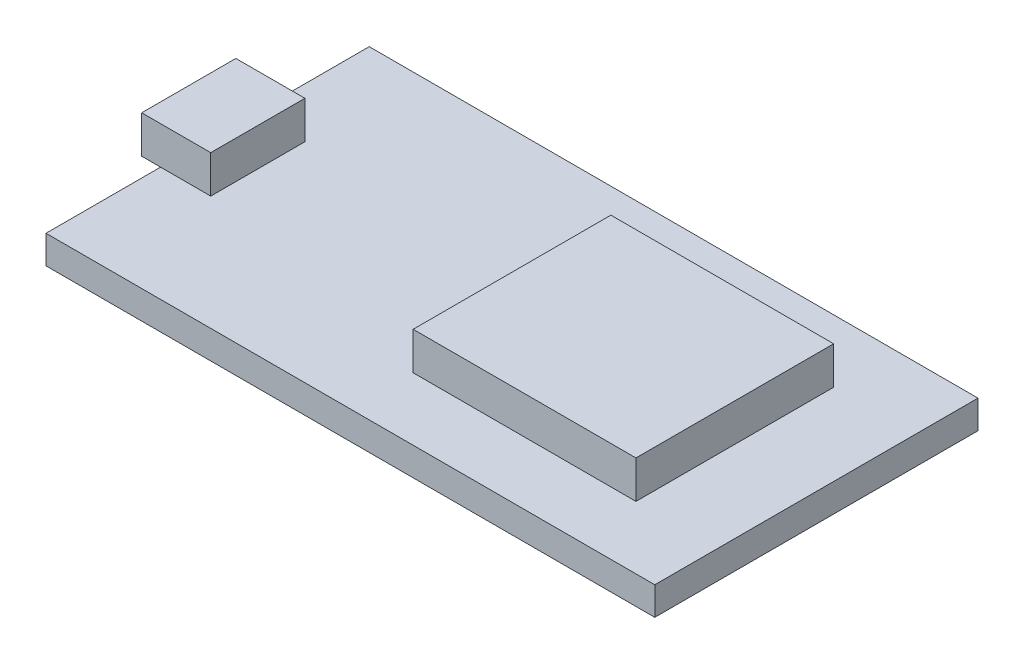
ISO-10303-21;
HEADER;
FILE_DESCRIPTION(('STEP AP214'),'2;1');
FILE_NAME('part.step','',(''),(''),'','','');
FILE_SCHEMA(('AUTOMOTIVE_DESIGN { 1 0 10303 214 1 1 1 1 }'));
ENDSEC;
DATA;
#1=APPLICATION_CONTEXT('core data for automotive mechanical design processes');
#2=APPLICATION_PROTOCOL_DEFINITION('international standard','automotive_design',2000,#1);
#3=PRODUCT_CONTEXT('',#1,'mechanical');
#4=PRODUCT('Part','Part','',(#3));
#5=PRODUCT_RELATED_PRODUCT_CATEGORY('part','',(#4));
#6=PRODUCT_DEFINITION_FORMATION('','',#4);
#7=PRODUCT_DEFINITION_CONTEXT('part definition',#1,'design');
#8=PRODUCT_DEFINITION('design','',#6,#7);
#9=PRODUCT_DEFINITION_SHAPE('','',#8);
#10=(LENGTH_UNIT() NAMED_UNIT(*) SI_UNIT(.MILLI.,.METRE.));
#11=(NAMED_UNIT(*) PLANE_ANGLE_UNIT() SI_UNIT($,.RADIAN.));
#12=(NAMED_UNIT(*) SI_UNIT($,.STERADIAN.) SOLID_ANGLE_UNIT());
#13=UNCERTAINTY_MEASURE_WITH_UNIT(LENGTH_MEASURE(1.E-05),#10,'distance_accuracy_value','');
#14=(GEOMETRIC_REPRESENTATION_CONTEXT(3) GLOBAL_UNCERTAINTY_ASSIGNED_CONTEXT((#13)) GLOBAL_UNIT_ASSIGNED_CONTEXT((#10,
#11,#12)) REPRESENTATION_CONTEXT('',''));
#15=CARTESIAN_POINT('',(0.,0.,0.));
#16=DIRECTION('',(0.,0.,1.));
#17=DIRECTION('',(1.,0.,0.));
#18=AXIS2_PLACEMENT_3D('',#15,#16,#17);
#19=CARTESIAN_POINT('',(-1.5,5.25,-9.125));
#20=DIRECTION('',(1.,0.,0.));
#21=DIRECTION('',(0.,0.,-1.));
#22=AXIS2_PLACEMENT_3D('',#19,#20,#21);
#23=PLANE('',#22);
#24=DIRECTION('',(0.,0.,1.));
#25=VECTOR('',#24,1.);
#26=CARTESIAN_POINT('',(-1.5,2.25,-9.125));
#27=LINE('',#26,#25);
#28=CARTESIAN_POINT('',(-1.5,2.25,-16.625));
#29=VERTEX_POINT('',#28);
#30=CARTESIAN_POINT('',(-1.5,2.25,-9.125));
#31=VERTEX_POINT('',#30);
#32=EDGE_CURVE('E320',#29,#31,#27,.T.);
#33=ORIENTED_EDGE('',*,*,#32,.T.);
#34=DIRECTION('',(0.,-1.,0.));
#35=VECTOR('',#34,1.);
#36=CARTESIAN_POINT('',(-1.5,5.25,-9.125));
#37=LINE('',#36,#35);
#38=CARTESIAN_POINT('',(-1.5,5.25,-9.125));
#39=VERTEX_POINT('',#38);
#40=EDGE_CURVE('E330',#39,#31,#37,.T.);
#41=ORIENTED_EDGE('',*,*,#40,.F.);
#42=DIRECTION('',(0.,0.,1.));
#43=VECTOR('',#42,1.);
#44=CARTESIAN_POINT('',(-1.5,5.25,-9.125));
#45=LINE('',#44,#43);
#46=CARTESIAN_POINT('',(-1.5,5.25,-16.625));
#47=VERTEX_POINT('',#46);
#48=EDGE_CURVE('E307',#47,#39,#45,.T.);
#49=ORIENTED_EDGE('',*,*,#48,.F.);
#50=DIRECTION('',(0.,-1.,0.));
#51=VECTOR('',#50,1.);
#52=CARTESIAN_POINT('',(-1.5,5.25,-16.625));
#53=LINE('',#52,#51);
#54=EDGE_CURVE('E334',#47,#29,#53,.T.);
#55=ORIENTED_EDGE('',*,*,#54,.T.);
#56=EDGE_LOOP('',(#33,#41,#49,#55));
#57=FACE_BOUND('',#56,.T.);
#58=DIRECTION('',(0.,0.,1.));
#59=VECTOR('',#58,1.);
#60=CARTESIAN_POINT('',(-1.5,2.75,-9.125));
#61=LINE('',#60,#59);
#62=CARTESIAN_POINT('',(-1.5,2.75,-16.125));
#63=VERTEX_POINT('',#62);
#64=CARTESIAN_POINT('',(-1.5,2.75,-9.625));
#65=VERTEX_POINT('',#64);
#66=EDGE_CURVE('E281',#63,#65,#61,.T.);
#67=ORIENTED_EDGE('',*,*,#66,.F.);
#68=DIRECTION('',(0.,-1.,0.));
#69=VECTOR('',#68,1.);
#70=CARTESIAN_POINT('',(-1.5,5.25,-16.125));
#71=LINE('',#70,#69);
#72=CARTESIAN_POINT('',(-1.5,4.75,-16.125));
#73=VERTEX_POINT('',#72);
#74=EDGE_CURVE('E290',#73,#63,#71,.T.);
#75=ORIENTED_EDGE('',*,*,#74,.F.);
#76=DIRECTION('',(0.,0.,1.));
#77=VECTOR('',#76,1.);
#78=CARTESIAN_POINT('',(-1.5,4.75,-9.125));
#79=LINE('',#78,#77);
#80=CARTESIAN_POINT('',(-1.5,4.75,-9.625));
#81=VERTEX_POINT('',#80);
#82=EDGE_CURVE('E55',#73,#81,#79,.T.);
#83=ORIENTED_EDGE('',*,*,#82,.T.);
#84=DIRECTION('',(0.,-1.,0.));
#85=VECTOR('',#84,1.);
#86=CARTESIAN_POINT('',(-1.5,5.25,-9.625));
#87=LINE('',#86,#85);
#88=EDGE_CURVE('E286',#81,#65,#87,.T.);
#89=ORIENTED_EDGE('',*,*,#88,.T.);
#90=EDGE_LOOP('',(#67,#75,#83,#89));
#91=FACE_BOUND('',#90,.T.);
#92=ADVANCED_FACE('F39',(#57,#91),#23,.F.);
#93=CARTESIAN_POINT('',(0.,2.25,0.));
#94=DIRECTION('',(0.,-1.,0.));
#95=DIRECTION('',(0.,0.,-1.));
#96=AXIS2_PLACEMENT_3D('',#93,#94,#95);
#97=PLANE('',#96);
#98=DIRECTION('',(0.,0.,1.));
#99=VECTOR('',#98,1.);
#100=CARTESIAN_POINT('',(24.25,2.25,-20.75));
#101=LINE('',#100,#99);
#102=CARTESIAN_POINT('',(24.25,2.25,-20.75));
#103=VERTEX_POINT('',#102);
#104=CARTESIAN_POINT('',(24.25,2.25,-5.));
#105=VERTEX_POINT('',#104);
#106=EDGE_CURVE('E341',#103,#105,#101,.T.);
#107=ORIENTED_EDGE('',*,*,#106,.F.);
#108=DIRECTION('',(-1.,0.,0.));
#109=VECTOR('',#108,1.);
#110=CARTESIAN_POINT('',(24.25,2.25,-20.75));
#111=LINE('',#110,#109);
#112=CARTESIAN_POINT('',(42.,2.25,-20.75));
#113=VERTEX_POINT('',#112);
#114=EDGE_CURVE('E347',#113,#103,#111,.T.);
#115=ORIENTED_EDGE('',*,*,#114,.F.);
#116=DIRECTION('',(0.,0.,-1.));
#117=VECTOR('',#116,1.);
#118=CARTESIAN_POINT('',(42.,2.25,-20.75));
#119=LINE('',#118,#117);
#120=CARTESIAN_POINT('',(42.,2.25,-5.));
#121=VERTEX_POINT('',#120);
#122=EDGE_CURVE('E364',#121,#113,#119,.T.);
#123=ORIENTED_EDGE('',*,*,#122,.F.);
#124=DIRECTION('',(1.,0.,0.));
#125=VECTOR('',#124,1.);
#126=CARTESIAN_POINT('',(24.25,2.25,-5.));
#127=LINE('',#126,#125);
#128=EDGE_CURVE('E360',#105,#121,#127,.T.);
#129=ORIENTED_EDGE('',*,*,#128,.F.);
#130=EDGE_LOOP('',(#107,#115,#123,#129));
#131=FACE_BOUND('',#130,.T.);
#132=DIRECTION('',(-1.,0.,0.));
#133=VECTOR('',#132,1.);
#134=CARTESIAN_POINT('',(4.,2.25,-16.625));
#135=LINE('',#134,#133);
#136=CARTESIAN_POINT('',(4.,2.25,-16.625));
#137=VERTEX_POINT('',#136);
#138=CARTESIAN_POINT('',(0.,2.25,-16.625));
#139=VERTEX_POINT('',#138);
#140=EDGE_CURVE('E63',#137,#139,#135,.T.);
#141=ORIENTED_EDGE('',*,*,#140,.F.);
#142=DIRECTION('',(0.,0.,-1.));
#143=VECTOR('',#142,1.);
#144=CARTESIAN_POINT('',(4.,2.25,-9.125));
#145=LINE('',#144,#143);
#146=CARTESIAN_POINT('',(4.,2.25,-9.125));
#147=VERTEX_POINT('',#146);
#148=EDGE_CURVE('E280',#147,#137,#145,.T.);
#149=ORIENTED_EDGE('',*,*,#148,.F.);
#150=DIRECTION('',(1.,0.,0.));
#151=VECTOR('',#150,1.);
#152=CARTESIAN_POINT('',(4.,2.25,-9.125));
#153=LINE('',#152,#151);
#154=CARTESIAN_POINT('',(0.,2.25,-9.125));
#155=VERTEX_POINT('',#154);
#156=EDGE_CURVE('E323',#155,#147,#153,.T.);
#157=ORIENTED_EDGE('',*,*,#156,.F.);
#158=DIRECTION('',(0.,0.,1.));
#159=VECTOR('',#158,1.);
#160=CARTESIAN_POINT('',(0.,2.25,0.));
#161=LINE('',#160,#159);
#162=CARTESIAN_POINT('',(0.,2.25,0.));
#163=VERTEX_POINT('',#162);
#164=EDGE_CURVE('E392',#155,#163,#161,.T.);
#165=ORIENTED_EDGE('',*,*,#164,.T.);
#166=DIRECTION('',(1.,0.,0.));
#167=VECTOR('',#166,1.);
#168=CARTESIAN_POINT('',(0.,2.25,0.));
#169=LINE('',#168,#167);
#170=CARTESIAN_POINT('',(48.5,2.25,0.));
#171=VERTEX_POINT('',#170);
#172=EDGE_CURVE('E390',#163,#171,#169,.T.);
#173=ORIENTED_EDGE('',*,*,#172,.T.);
#174=DIRECTION('',(0.,0.,-1.));
#175=VECTOR('',#174,1.);
#176=CARTESIAN_POINT('',(48.5,2.25,0.));
#177=LINE('',#176,#175);
#178=CARTESIAN_POINT('',(48.5,2.25,-25.75));
#179=VERTEX_POINT('',#178);
#180=EDGE_CURVE('E395',#171,#179,#177,.T.);
#181=ORIENTED_EDGE('',*,*,#180,.T.);
#182=DIRECTION('',(-1.,0.,0.));
#183=VECTOR('',#182,1.);
#184=CARTESIAN_POINT('',(0.,2.25,-25.75));
#185=LINE('',#184,#183);
#186=CARTESIAN_POINT('',(0.,2.25,-25.75));
#187=VERTEX_POINT('',#186);
#188=EDGE_CURVE('E398',#179,#187,#185,.T.);
#189=ORIENTED_EDGE('',*,*,#188,.T.);
#190=EDGE_CURVE('E387',#187,#139,#161,.T.);
#191=ORIENTED_EDGE('',*,*,#190,.T.);
#192=EDGE_LOOP('',(#141,#149,#157,#165,#173,#181,#189,#191));
#193=FACE_BOUND('',#192,.T.);
#194=ADVANCED_FACE('F443',(#131,#193),#97,.F.);
#195=CARTESIAN_POINT('',(0.,2.25,0.));
#196=DIRECTION('',(1.,0.,0.));
#197=DIRECTION('',(0.,0.,-1.));
#198=AXIS2_PLACEMENT_3D('',#195,#196,#197);
#199=PLANE('',#198);
#200=DIRECTION('',(0.,0.,1.));
#201=VECTOR('',#200,1.);
#202=CARTESIAN_POINT('',(0.,0.,0.));
#203=LINE('',#202,#201);
#204=CARTESIAN_POINT('',(0.,0.,-25.75));
#205=VERTEX_POINT('',#204);
#206=CARTESIAN_POINT('',(0.,0.,0.));
#207=VERTEX_POINT('',#206);
#208=EDGE_CURVE('E386',#205,#207,#203,.T.);
#209=ORIENTED_EDGE('',*,*,#208,.T.);
#210=DIRECTION('',(0.,-1.,0.));
#211=VECTOR('',#210,1.);
#212=CARTESIAN_POINT('',(0.,2.25,0.));
#213=LINE('',#212,#211);
#214=EDGE_CURVE('E11',#163,#207,#213,.T.);
#215=ORIENTED_EDGE('',*,*,#214,.F.);
#216=ORIENTED_EDGE('',*,*,#164,.F.);
#217=EDGE_CURVE('E391',#139,#155,#161,.T.);
#218=ORIENTED_EDGE('',*,*,#217,.F.);
#219=ORIENTED_EDGE('',*,*,#190,.F.);
#220=DIRECTION('',(0.,-1.,0.));
#221=VECTOR('',#220,1.);
#222=CARTESIAN_POINT('',(0.,2.25,-25.75));
#223=LINE('',#222,#221);
#224=EDGE_CURVE('E401',#187,#205,#223,.T.);
#225=ORIENTED_EDGE('',*,*,#224,.T.);
#226=EDGE_LOOP('',(#209,#215,#216,#218,#219,#225));
#227=FACE_BOUND('',#226,.T.);
#228=ADVANCED_FACE('F41',(#227),#199,.F.);
#229=CARTESIAN_POINT('',(0.,2.25,0.));
#230=DIRECTION('',(0.,0.,-1.));
#231=DIRECTION('',(-1.,0.,0.));
#232=AXIS2_PLACEMENT_3D('',#229,#230,#231);
#233=PLANE('',#232);
#234=DIRECTION('',(1.,0.,0.));
#235=VECTOR('',#234,1.);
#236=CARTESIAN_POINT('',(0.,0.,0.));
#237=LINE('',#236,#235);
#238=CARTESIAN_POINT('',(48.5,0.,0.));
#239=VERTEX_POINT('',#238);
#240=EDGE_CURVE('E405',#207,#239,#237,.T.);
#241=ORIENTED_EDGE('',*,*,#240,.T.);
#242=DIRECTION('',(0.,-1.,0.));
#243=VECTOR('',#242,1.);
#244=CARTESIAN_POINT('',(48.5,2.25,0.));
#245=LINE('',#244,#243);
#246=EDGE_CURVE('E48',#171,#239,#245,.T.);
#247=ORIENTED_EDGE('',*,*,#246,.F.);
#248=ORIENTED_EDGE('',*,*,#172,.F.);
#249=ORIENTED_EDGE('',*,*,#214,.T.);
#250=EDGE_LOOP('',(#241,#247,#248,#249));
#251=FACE_BOUND('',#250,.T.);
#252=ADVANCED_FACE('F607',(#251),#233,.F.);
#253=CARTESIAN_POINT('',(48.5,2.25,0.));
#254=DIRECTION('',(-1.,0.,0.));
#255=DIRECTION('',(0.,0.,1.));
#256=AXIS2_PLACEMENT_3D('',#253,#254,#255);
#257=PLANE('',#256);
#258=DIRECTION('',(0.,0.,-1.));
#259=VECTOR('',#258,1.);
#260=CARTESIAN_POINT('',(48.5,0.,0.));
#261=LINE('',#260,#259);
#262=CARTESIAN_POINT('',(48.5,0.,-25.75));
#263=VERTEX_POINT('',#262);
#264=EDGE_CURVE('E408',#239,#263,#261,.T.);
#265=ORIENTED_EDGE('',*,*,#264,.T.);
#266=DIRECTION('',(0.,-1.,0.));
#267=VECTOR('',#266,1.);
#268=CARTESIAN_POINT('',(48.5,2.25,-25.75));
#269=LINE('',#268,#267);
#270=EDGE_CURVE('E417',#179,#263,#269,.T.);
#271=ORIENTED_EDGE('',*,*,#270,.F.);
#272=ORIENTED_EDGE('',*,*,#180,.F.);
#273=ORIENTED_EDGE('',*,*,#246,.T.);
#274=EDGE_LOOP('',(#265,#271,#272,#273));
#275=FACE_BOUND('',#274,.T.);
#276=ADVANCED_FACE('F426',(#275),#257,.F.);
#277=CARTESIAN_POINT('',(0.,2.25,-25.75));
#278=DIRECTION('',(0.,0.,1.));
#279=DIRECTION('',(1.,0.,0.));
#280=AXIS2_PLACEMENT_3D('',#277,#278,#279);
#281=PLANE('',#280);
#282=DIRECTION('',(-1.,0.,0.));
#283=VECTOR('',#282,1.);
#284=CARTESIAN_POINT('',(0.,0.,-25.75));
#285=LINE('',#284,#283);
#286=EDGE_CURVE('E411',#263,#205,#285,.T.);
#287=ORIENTED_EDGE('',*,*,#286,.T.);
#288=ORIENTED_EDGE('',*,*,#224,.F.);
#289=ORIENTED_EDGE('',*,*,#188,.F.);
#290=ORIENTED_EDGE('',*,*,#270,.T.);
#291=EDGE_LOOP('',(#287,#288,#289,#290));
#292=FACE_BOUND('',#291,.T.);
#293=ADVANCED_FACE('F436',(#292),#281,.F.);
#294=CARTESIAN_POINT('',(0.,0.,0.));
#295=DIRECTION('',(0.,-1.,0.));
#296=DIRECTION('',(0.,0.,-1.));
#297=AXIS2_PLACEMENT_3D('',#294,#295,#296);
#298=PLANE('',#297);
#299=ORIENTED_EDGE('',*,*,#208,.F.);
#300=ORIENTED_EDGE('',*,*,#286,.F.);
#301=ORIENTED_EDGE('',*,*,#264,.F.);
#302=ORIENTED_EDGE('',*,*,#240,.F.);
#303=EDGE_LOOP('',(#299,#300,#301,#302));
#304=FACE_BOUND('',#303,.T.);
#305=ADVANCED_FACE('F433',(#304),#298,.T.);
#306=CARTESIAN_POINT('',(24.25,5.25,-20.75));
#307=DIRECTION('',(1.,0.,0.));
#308=DIRECTION('',(0.,0.,-1.));
#309=AXIS2_PLACEMENT_3D('',#306,#307,#308);
#310=PLANE('',#309);
#311=ORIENTED_EDGE('',*,*,#106,.T.);
#312=DIRECTION('',(0.,-1.,0.));
#313=VECTOR('',#312,1.);
#314=CARTESIAN_POINT('',(24.25,5.25,-5.));
#315=LINE('',#314,#313);
#316=CARTESIAN_POINT('',(24.25,5.25,-5.));
#317=VERTEX_POINT('',#316);
#318=EDGE_CURVE('E382',#317,#105,#315,.T.);
#319=ORIENTED_EDGE('',*,*,#318,.F.);
#320=DIRECTION('',(0.,0.,1.));
#321=VECTOR('',#320,1.);
#322=CARTESIAN_POINT('',(24.25,5.25,-20.75));
#323=LINE('',#322,#321);
#324=CARTESIAN_POINT('',(24.25,5.25,-20.75));
#325=VERTEX_POINT('',#324);
#326=EDGE_CURVE('E342',#325,#317,#323,.T.);
#327=ORIENTED_EDGE('',*,*,#326,.F.);
#328=DIRECTION('',(0.,-1.,0.));
#329=VECTOR('',#328,1.);
#330=CARTESIAN_POINT('',(24.25,5.25,-20.75));
#331=LINE('',#330,#329);
#332=EDGE_CURVE('E356',#325,#103,#331,.T.);
#333=ORIENTED_EDGE('',*,*,#332,.T.);
#334=EDGE_LOOP('',(#311,#319,#327,#333));
#335=FACE_BOUND('',#334,.T.);
#336=ADVANCED_FACE('F597',(#335),#310,.F.);
#337=CARTESIAN_POINT('',(24.25,5.25,-5.));
#338=DIRECTION('',(0.,0.,-1.));
#339=DIRECTION('',(-1.,0.,0.));
#340=AXIS2_PLACEMENT_3D('',#337,#338,#339);
#341=PLANE('',#340);
#342=ORIENTED_EDGE('',*,*,#128,.T.);
#343=DIRECTION('',(0.,-1.,0.));
#344=VECTOR('',#343,1.);
#345=CARTESIAN_POINT('',(42.,5.25,-5.));
#346=LINE('',#345,#344);
#347=CARTESIAN_POINT('',(42.,5.25,-5.));
#348=VERTEX_POINT('',#347);
#349=EDGE_CURVE('E378',#348,#121,#346,.T.);
#350=ORIENTED_EDGE('',*,*,#349,.F.);
#351=DIRECTION('',(1.,0.,0.));
#352=VECTOR('',#351,1.);
#353=CARTESIAN_POINT('',(24.25,5.25,-5.));
#354=LINE('',#353,#352);
#355=EDGE_CURVE('E346',#317,#348,#354,.T.);
#356=ORIENTED_EDGE('',*,*,#355,.F.);
#357=ORIENTED_EDGE('',*,*,#318,.T.);
#358=EDGE_LOOP('',(#342,#350,#356,#357));
#359=FACE_BOUND('',#358,.T.);
#360=ADVANCED_FACE('F593',(#359),#341,.F.);
#361=CARTESIAN_POINT('',(42.,5.25,-20.75));
#362=DIRECTION('',(-1.,0.,0.));
#363=DIRECTION('',(0.,0.,1.));
#364=AXIS2_PLACEMENT_3D('',#361,#362,#363);
#365=PLANE('',#364);
#366=ORIENTED_EDGE('',*,*,#122,.T.);
#367=DIRECTION('',(0.,-1.,0.));
#368=VECTOR('',#367,1.);
#369=CARTESIAN_POINT('',(42.,5.25,-20.75));
#370=LINE('',#369,#368);
#371=CARTESIAN_POINT('',(42.,5.25,-20.75));
#372=VERTEX_POINT('',#371);
#373=EDGE_CURVE('E374',#372,#113,#370,.T.);
#374=ORIENTED_EDGE('',*,*,#373,.F.);
#375=DIRECTION('',(0.,0.,-1.));
#376=VECTOR('',#375,1.);
#377=CARTESIAN_POINT('',(42.,5.25,-20.75));
#378=LINE('',#377,#376);
#379=EDGE_CURVE('E350',#348,#372,#378,.T.);
#380=ORIENTED_EDGE('',*,*,#379,.F.);
#381=ORIENTED_EDGE('',*,*,#349,.T.);
#382=EDGE_LOOP('',(#366,#374,#380,#381));
#383=FACE_BOUND('',#382,.T.);
#384=ADVANCED_FACE('F589',(#383),#365,.F.);
#385=CARTESIAN_POINT('',(24.25,5.25,-20.75));
#386=DIRECTION('',(0.,0.,1.));
#387=DIRECTION('',(1.,0.,0.));
#388=AXIS2_PLACEMENT_3D('',#385,#386,#387);
#389=PLANE('',#388);
#390=ORIENTED_EDGE('',*,*,#114,.T.);
#391=ORIENTED_EDGE('',*,*,#332,.F.);
#392=DIRECTION('',(-1.,0.,0.));
#393=VECTOR('',#392,1.);
#394=CARTESIAN_POINT('',(24.25,5.25,-20.75));
#395=LINE('',#394,#393);
#396=EDGE_CURVE('E353',#372,#325,#395,.T.);
#397=ORIENTED_EDGE('',*,*,#396,.F.);
#398=ORIENTED_EDGE('',*,*,#373,.T.);
#399=EDGE_LOOP('',(#390,#391,#397,#398));
#400=FACE_BOUND('',#399,.T.);
#401=ADVANCED_FACE('F585',(#400),#389,.F.);
#402=CARTESIAN_POINT('',(0.,5.25,0.));
#403=DIRECTION('',(0.,1.,0.));
#404=DIRECTION('',(0.,0.,1.));
#405=AXIS2_PLACEMENT_3D('',#402,#403,#404);
#406=PLANE('',#405);
#407=ORIENTED_EDGE('',*,*,#326,.T.);
#408=ORIENTED_EDGE('',*,*,#355,.T.);
#409=ORIENTED_EDGE('',*,*,#379,.T.);
#410=ORIENTED_EDGE('',*,*,#396,.T.);
#411=EDGE_LOOP('',(#407,#408,#409,#410));
#412=FACE_BOUND('',#411,.T.);
#413=ADVANCED_FACE('F582',(#412),#406,.T.);
#414=CARTESIAN_POINT('',(0.,2.25,0.));
#415=DIRECTION('',(0.,1.,0.));
#416=DIRECTION('',(0.,0.,1.));
#417=AXIS2_PLACEMENT_3D('',#414,#415,#416);
#418=PLANE('',#417);
#419=EDGE_CURVE('E317',#139,#29,#135,.T.);
#420=ORIENTED_EDGE('',*,*,#419,.F.);
#421=ORIENTED_EDGE('',*,*,#217,.T.);
#422=EDGE_CURVE('E304',#31,#155,#153,.T.);
#423=ORIENTED_EDGE('',*,*,#422,.F.);
#424=ORIENTED_EDGE('',*,*,#32,.F.);
#425=EDGE_LOOP('',(#420,#421,#423,#424));
#426=FACE_BOUND('',#425,.T.);
#427=ADVANCED_FACE('F446',(#426),#418,.F.);
#428=CARTESIAN_POINT('',(4.,5.25,-9.125));
#429=DIRECTION('',(-1.,0.,0.));
#430=DIRECTION('',(0.,0.,1.));
#431=AXIS2_PLACEMENT_3D('',#428,#429,#430);
#432=PLANE('',#431);
#433=ORIENTED_EDGE('',*,*,#148,.T.);
#434=DIRECTION('',(0.,-1.,0.));
#435=VECTOR('',#434,1.);
#436=CARTESIAN_POINT('',(4.,5.25,-16.625));
#437=LINE('',#436,#435);
#438=CARTESIAN_POINT('',(4.,5.25,-16.625));
#439=VERTEX_POINT('',#438);
#440=EDGE_CURVE('E338',#439,#137,#437,.T.);
#441=ORIENTED_EDGE('',*,*,#440,.F.);
#442=DIRECTION('',(0.,0.,-1.));
#443=VECTOR('',#442,1.);
#444=CARTESIAN_POINT('',(4.,5.25,-9.125));
#445=LINE('',#444,#443);
#446=CARTESIAN_POINT('',(4.,5.25,-9.125));
#447=VERTEX_POINT('',#446);
#448=EDGE_CURVE('E299',#447,#439,#445,.T.);
#449=ORIENTED_EDGE('',*,*,#448,.F.);
#450=DIRECTION('',(0.,-1.,0.));
#451=VECTOR('',#450,1.);
#452=CARTESIAN_POINT('',(4.,5.25,-9.125));
#453=LINE('',#452,#451);
#454=EDGE_CURVE('E313',#447,#147,#453,.T.);
#455=ORIENTED_EDGE('',*,*,#454,.T.);
#456=EDGE_LOOP('',(#433,#441,#449,#455));
#457=FACE_BOUND('',#456,.T.);
#458=ADVANCED_FACE('F455',(#457),#432,.F.);
#459=CARTESIAN_POINT('',(4.,5.25,-16.625));
#460=DIRECTION('',(0.,0.,1.));
#461=DIRECTION('',(1.,0.,0.));
#462=AXIS2_PLACEMENT_3D('',#459,#460,#461);
#463=PLANE('',#462);
#464=ORIENTED_EDGE('',*,*,#140,.T.);
#465=ORIENTED_EDGE('',*,*,#419,.T.);
#466=ORIENTED_EDGE('',*,*,#54,.F.);
#467=DIRECTION('',(-1.,0.,0.));
#468=VECTOR('',#467,1.);
#469=CARTESIAN_POINT('',(4.,5.25,-16.625));
#470=LINE('',#469,#468);
#471=EDGE_CURVE('E303',#439,#47,#470,.T.);
#472=ORIENTED_EDGE('',*,*,#471,.F.);
#473=ORIENTED_EDGE('',*,*,#440,.T.);
#474=EDGE_LOOP('',(#464,#465,#466,#472,#473));
#475=FACE_BOUND('',#474,.T.);
#476=ADVANCED_FACE('F451',(#475),#463,.F.);
#477=CARTESIAN_POINT('',(4.,5.25,-9.125));
#478=DIRECTION('',(0.,0.,-1.));
#479=DIRECTION('',(-1.,0.,0.));
#480=AXIS2_PLACEMENT_3D('',#477,#478,#479);
#481=PLANE('',#480);
#482=ORIENTED_EDGE('',*,*,#422,.T.);
#483=ORIENTED_EDGE('',*,*,#156,.T.);
#484=ORIENTED_EDGE('',*,*,#454,.F.);
#485=DIRECTION('',(1.,0.,0.));
#486=VECTOR('',#485,1.);
#487=CARTESIAN_POINT('',(4.,5.25,-9.125));
#488=LINE('',#487,#486);
#489=EDGE_CURVE('E310',#39,#447,#488,.T.);
#490=ORIENTED_EDGE('',*,*,#489,.F.);
#491=ORIENTED_EDGE('',*,*,#40,.T.);
#492=EDGE_LOOP('',(#482,#483,#484,#490,#491));
#493=FACE_BOUND('',#492,.T.);
#494=ADVANCED_FACE('F460',(#493),#481,.F.);
#495=CARTESIAN_POINT('',(0.,5.25,0.));
#496=DIRECTION('',(0.,1.,0.));
#497=DIRECTION('',(0.,0.,1.));
#498=AXIS2_PLACEMENT_3D('',#495,#496,#497);
#499=PLANE('',#498);
#500=ORIENTED_EDGE('',*,*,#448,.T.);
#501=ORIENTED_EDGE('',*,*,#471,.T.);
#502=ORIENTED_EDGE('',*,*,#48,.T.);
#503=ORIENTED_EDGE('',*,*,#489,.T.);
#504=EDGE_LOOP('',(#500,#501,#502,#503));
#505=FACE_BOUND('',#504,.T.);
#506=ADVANCED_FACE('F685',(#505),#499,.T.);
#507=CARTESIAN_POINT('',(0.,1.75,0.));
#508=DIRECTION('',(0.,-1.,0.));
#509=DIRECTION('',(0.,0.,-1.));
#510=AXIS2_PLACEMENT_3D('',#507,#508,#509);
#511=PLANE('',#510);
#512=DIRECTION('',(0.,0.,1.));
#513=VECTOR('',#512,1.);
#514=CARTESIAN_POINT('',(24.75,1.75,0.));
#515=LINE('',#514,#513);
#516=CARTESIAN_POINT('',(24.75,1.75,-20.25));
#517=VERTEX_POINT('',#516);
#518=CARTESIAN_POINT('',(24.75,1.75,-5.5));
#519=VERTEX_POINT('',#518);
#520=EDGE_CURVE('E222',#517,#519,#515,.T.);
#521=ORIENTED_EDGE('',*,*,#520,.T.);
#522=DIRECTION('',(1.,0.,0.));
#523=VECTOR('',#522,1.);
#524=CARTESIAN_POINT('',(0.,1.75,-5.5));
#525=LINE('',#524,#523);
#526=CARTESIAN_POINT('',(41.5,1.75,-5.5));
#527=VERTEX_POINT('',#526);
#528=EDGE_CURVE('E234',#519,#527,#525,.T.);
#529=ORIENTED_EDGE('',*,*,#528,.T.);
#530=DIRECTION('',(0.,0.,-1.));
#531=VECTOR('',#530,1.);
#532=CARTESIAN_POINT('',(41.5,1.75,0.));
#533=LINE('',#532,#531);
#534=CARTESIAN_POINT('',(41.5,1.75,-20.25));
#535=VERTEX_POINT('',#534);
#536=EDGE_CURVE('E241',#527,#535,#533,.T.);
#537=ORIENTED_EDGE('',*,*,#536,.T.);
#538=DIRECTION('',(-1.,0.,0.));
#539=VECTOR('',#538,1.);
#540=CARTESIAN_POINT('',(0.,1.75,-20.25));
#541=LINE('',#540,#539);
#542=EDGE_CURVE('E238',#535,#517,#541,.T.);
#543=ORIENTED_EDGE('',*,*,#542,.T.);
#544=EDGE_LOOP('',(#521,#529,#537,#543));
#545=FACE_BOUND('',#544,.T.);
#546=DIRECTION('',(-1.,0.,0.));
#547=VECTOR('',#546,1.);
#548=CARTESIAN_POINT('',(0.,1.75,-16.125));
#549=LINE('',#548,#547);
#550=CARTESIAN_POINT('',(3.5,1.75,-16.125));
#551=VERTEX_POINT('',#550);
#552=CARTESIAN_POINT('',(0.5,1.75,-16.125));
#553=VERTEX_POINT('',#552);
#554=EDGE_CURVE('E285',#551,#553,#549,.T.);
#555=ORIENTED_EDGE('',*,*,#554,.T.);
#556=DIRECTION('',(0.,0.,1.));
#557=VECTOR('',#556,1.);
#558=CARTESIAN_POINT('',(0.5,1.75,0.));
#559=LINE('',#558,#557);
#560=CARTESIAN_POINT('',(0.5,1.75,-25.25));
#561=VERTEX_POINT('',#560);
#562=EDGE_CURVE('E487',#561,#553,#559,.T.);
#563=ORIENTED_EDGE('',*,*,#562,.F.);
#564=DIRECTION('',(-1.,0.,0.));
#565=VECTOR('',#564,1.);
#566=CARTESIAN_POINT('',(0.,1.75,-25.25));
#567=LINE('',#566,#565);
#568=CARTESIAN_POINT('',(48.,1.75,-25.25));
#569=VERTEX_POINT('',#568);
#570=EDGE_CURVE('E478',#569,#561,#567,.T.);
#571=ORIENTED_EDGE('',*,*,#570,.F.);
#572=DIRECTION('',(0.,0.,-1.));
#573=VECTOR('',#572,1.);
#574=CARTESIAN_POINT('',(48.,1.75,0.));
#575=LINE('',#574,#573);
#576=CARTESIAN_POINT('',(48.,1.75,-0.5));
#577=VERTEX_POINT('',#576);
#578=EDGE_CURVE('E481',#577,#569,#575,.T.);
#579=ORIENTED_EDGE('',*,*,#578,.F.);
#580=DIRECTION('',(1.,0.,0.));
#581=VECTOR('',#580,1.);
#582=CARTESIAN_POINT('',(0.,1.75,-0.5));
#583=LINE('',#582,#581);
#584=CARTESIAN_POINT('',(0.5,1.75,-0.5));
#585=VERTEX_POINT('',#584);
#586=EDGE_CURVE('E484',#585,#577,#583,.T.);
#587=ORIENTED_EDGE('',*,*,#586,.F.);
#588=DIRECTION('',(0.,0.,1.));
#589=VECTOR('',#588,1.);
#590=CARTESIAN_POINT('',(0.5,1.75,0.));
#591=LINE('',#590,#589);
#592=CARTESIAN_POINT('',(0.5,1.75,-9.625));
#593=VERTEX_POINT('',#592);
#594=EDGE_CURVE('E495',#593,#585,#591,.T.);
#595=ORIENTED_EDGE('',*,*,#594,.F.);
#596=DIRECTION('',(1.,0.,0.));
#597=VECTOR('',#596,1.);
#598=CARTESIAN_POINT('',(0.,1.75,-9.625));
#599=LINE('',#598,#597);
#600=CARTESIAN_POINT('',(3.5,1.75,-9.625));
#601=VERTEX_POINT('',#600);
#602=EDGE_CURVE('E284',#593,#601,#599,.T.);
#603=ORIENTED_EDGE('',*,*,#602,.T.);
#604=DIRECTION('',(0.,0.,-1.));
#605=VECTOR('',#604,1.);
#606=CARTESIAN_POINT('',(3.5,1.75,0.));
#607=LINE('',#606,#605);
#608=EDGE_CURVE('E532',#601,#551,#607,.T.);
#609=ORIENTED_EDGE('',*,*,#608,.T.);
#610=EDGE_LOOP('',(#555,#563,#571,#579,#587,#595,#603,#609));
#611=FACE_BOUND('',#610,.T.);
#612=ADVANCED_FACE('F239',(#545,#611),#511,.T.);
#613=CARTESIAN_POINT('',(0.5,2.25,0.));
#614=DIRECTION('',(1.,0.,0.));
#615=DIRECTION('',(0.,0.,-1.));
#616=AXIS2_PLACEMENT_3D('',#613,#614,#615);
#617=PLANE('',#616);
#618=DIRECTION('',(0.,0.,1.));
#619=VECTOR('',#618,1.);
#620=CARTESIAN_POINT('',(0.5,0.5,0.));
#621=LINE('',#620,#619);
#622=CARTESIAN_POINT('',(0.5,0.5,-25.25));
#623=VERTEX_POINT('',#622);
#624=CARTESIAN_POINT('',(0.5,0.5,-0.5));
#625=VERTEX_POINT('',#624);
#626=EDGE_CURVE('E507',#623,#625,#621,.T.);
#627=ORIENTED_EDGE('',*,*,#626,.F.);
#628=DIRECTION('',(0.,-1.,0.));
#629=VECTOR('',#628,1.);
#630=CARTESIAN_POINT('',(0.5,2.25,-25.25));
#631=LINE('',#630,#629);
#632=EDGE_CURVE('E474',#561,#623,#631,.T.);
#633=ORIENTED_EDGE('',*,*,#632,.F.);
#634=ORIENTED_EDGE('',*,*,#562,.T.);
#635=DIRECTION('',(0.,1.,0.));
#636=VECTOR('',#635,1.);
#637=CARTESIAN_POINT('',(0.5,5.25,-16.125));
#638=LINE('',#637,#636);
#639=CARTESIAN_POINT('',(0.5,2.75,-16.125));
#640=VERTEX_POINT('',#639);
#641=EDGE_CURVE('E271',#553,#640,#638,.T.);
#642=ORIENTED_EDGE('',*,*,#641,.T.);
#643=DIRECTION('',(0.,0.,1.));
#644=VECTOR('',#643,1.);
#645=CARTESIAN_POINT('',(0.5,2.75,0.));
#646=LINE('',#645,#644);
#647=CARTESIAN_POINT('',(0.5,2.75,-9.625));
#648=VERTEX_POINT('',#647);
#649=EDGE_CURVE('E491',#640,#648,#646,.T.);
#650=ORIENTED_EDGE('',*,*,#649,.T.);
#651=DIRECTION('',(0.,1.,0.));
#652=VECTOR('',#651,1.);
#653=CARTESIAN_POINT('',(0.5,2.25,-9.625));
#654=LINE('',#653,#652);
#655=EDGE_CURVE('E275',#593,#648,#654,.T.);
#656=ORIENTED_EDGE('',*,*,#655,.F.);
#657=ORIENTED_EDGE('',*,*,#594,.T.);
#658=DIRECTION('',(0.,-1.,0.));
#659=VECTOR('',#658,1.);
#660=CARTESIAN_POINT('',(0.5,2.25,-0.5));
#661=LINE('',#660,#659);
#662=EDGE_CURVE('E276',#585,#625,#661,.T.);
#663=ORIENTED_EDGE('',*,*,#662,.T.);
#664=EDGE_LOOP('',(#627,#633,#634,#642,#650,#656,#657,#663));
#665=FACE_BOUND('',#664,.T.);
#666=ADVANCED_FACE('F698',(#665),#617,.T.);
#667=CARTESIAN_POINT('',(0.,2.25,-0.5));
#668=DIRECTION('',(0.,0.,-1.));
#669=DIRECTION('',(-1.,0.,0.));
#670=AXIS2_PLACEMENT_3D('',#667,#668,#669);
#671=PLANE('',#670);
#672=DIRECTION('',(1.,0.,0.));
#673=VECTOR('',#672,1.);
#674=CARTESIAN_POINT('',(0.,0.5,-0.5));
#675=LINE('',#674,#673);
#676=CARTESIAN_POINT('',(48.,0.5,-0.5));
#677=VERTEX_POINT('',#676);
#678=EDGE_CURVE('E504',#625,#677,#675,.T.);
#679=ORIENTED_EDGE('',*,*,#678,.F.);
#680=ORIENTED_EDGE('',*,*,#662,.F.);
#681=ORIENTED_EDGE('',*,*,#586,.T.);
#682=DIRECTION('',(0.,-1.,0.));
#683=VECTOR('',#682,1.);
#684=CARTESIAN_POINT('',(48.,2.25,-0.5));
#685=LINE('',#684,#683);
#686=EDGE_CURVE('E466',#577,#677,#685,.T.);
#687=ORIENTED_EDGE('',*,*,#686,.T.);
#688=EDGE_LOOP('',(#679,#680,#681,#687));
#689=FACE_BOUND('',#688,.T.);
#690=ADVANCED_FACE('F705',(#689),#671,.T.);
#691=CARTESIAN_POINT('',(48.,2.25,0.));
#692=DIRECTION('',(-1.,0.,0.));
#693=DIRECTION('',(0.,0.,1.));
#694=AXIS2_PLACEMENT_3D('',#691,#692,#693);
#695=PLANE('',#694);
#696=DIRECTION('',(0.,0.,-1.));
#697=VECTOR('',#696,1.);
#698=CARTESIAN_POINT('',(48.,0.5,0.));
#699=LINE('',#698,#697);
#700=CARTESIAN_POINT('',(48.,0.5,-25.25));
#701=VERTEX_POINT('',#700);
#702=EDGE_CURVE('E501',#677,#701,#699,.T.);
#703=ORIENTED_EDGE('',*,*,#702,.F.);
#704=ORIENTED_EDGE('',*,*,#686,.F.);
#705=ORIENTED_EDGE('',*,*,#578,.T.);
#706=DIRECTION('',(0.,-1.,0.));
#707=VECTOR('',#706,1.);
#708=CARTESIAN_POINT('',(48.,2.25,-25.25));
#709=LINE('',#708,#707);
#710=EDGE_CURVE('E470',#569,#701,#709,.T.);
#711=ORIENTED_EDGE('',*,*,#710,.T.);
#712=EDGE_LOOP('',(#703,#704,#705,#711));
#713=FACE_BOUND('',#712,.T.);
#714=ADVANCED_FACE('F713',(#713),#695,.T.);
#715=CARTESIAN_POINT('',(0.,2.25,-25.25));
#716=DIRECTION('',(0.,0.,1.));
#717=DIRECTION('',(1.,0.,0.));
#718=AXIS2_PLACEMENT_3D('',#715,#716,#717);
#719=PLANE('',#718);
#720=DIRECTION('',(-1.,0.,0.));
#721=VECTOR('',#720,1.);
#722=CARTESIAN_POINT('',(0.,0.5,-25.25));
#723=LINE('',#722,#721);
#724=EDGE_CURVE('E498',#701,#623,#723,.T.);
#725=ORIENTED_EDGE('',*,*,#724,.F.);
#726=ORIENTED_EDGE('',*,*,#710,.F.);
#727=ORIENTED_EDGE('',*,*,#570,.T.);
#728=ORIENTED_EDGE('',*,*,#632,.T.);
#729=EDGE_LOOP('',(#725,#726,#727,#728));
#730=FACE_BOUND('',#729,.T.);
#731=ADVANCED_FACE('F721',(#730),#719,.T.);
#732=CARTESIAN_POINT('',(0.,0.5,0.));
#733=DIRECTION('',(0.,-1.,0.));
#734=DIRECTION('',(0.,0.,-1.));
#735=AXIS2_PLACEMENT_3D('',#732,#733,#734);
#736=PLANE('',#735);
#737=ORIENTED_EDGE('',*,*,#626,.T.);
#738=ORIENTED_EDGE('',*,*,#678,.T.);
#739=ORIENTED_EDGE('',*,*,#702,.T.);
#740=ORIENTED_EDGE('',*,*,#724,.T.);
#741=EDGE_LOOP('',(#737,#738,#739,#740));
#742=FACE_BOUND('',#741,.T.);
#743=ADVANCED_FACE('F729',(#742),#736,.F.);
#744=CARTESIAN_POINT('',(24.75,5.25,-20.75));
#745=DIRECTION('',(1.,0.,0.));
#746=DIRECTION('',(0.,0.,-1.));
#747=AXIS2_PLACEMENT_3D('',#744,#745,#746);
#748=PLANE('',#747);
#749=ORIENTED_EDGE('',*,*,#520,.F.);
#750=DIRECTION('',(0.,-1.,0.));
#751=VECTOR('',#750,1.);
#752=CARTESIAN_POINT('',(24.75,5.25,-20.25));
#753=LINE('',#752,#751);
#754=CARTESIAN_POINT('',(24.75,4.75,-20.25));
#755=VERTEX_POINT('',#754);
#756=EDGE_CURVE('E227',#755,#517,#753,.T.);
#757=ORIENTED_EDGE('',*,*,#756,.F.);
#758=DIRECTION('',(0.,0.,1.));
#759=VECTOR('',#758,1.);
#760=CARTESIAN_POINT('',(24.75,4.75,-20.75));
#761=LINE('',#760,#759);
#762=CARTESIAN_POINT('',(24.75,4.75,-5.5));
#763=VERTEX_POINT('',#762);
#764=EDGE_CURVE('E246',#755,#763,#761,.T.);
#765=ORIENTED_EDGE('',*,*,#764,.T.);
#766=DIRECTION('',(0.,-1.,0.));
#767=VECTOR('',#766,1.);
#768=CARTESIAN_POINT('',(24.75,5.25,-5.5));
#769=LINE('',#768,#767);
#770=EDGE_CURVE('E230',#763,#519,#769,.T.);
#771=ORIENTED_EDGE('',*,*,#770,.T.);
#772=EDGE_LOOP('',(#749,#757,#765,#771));
#773=FACE_BOUND('',#772,.T.);
#774=ADVANCED_FACE('F224',(#773),#748,.T.);
#775=CARTESIAN_POINT('',(24.25,5.25,-5.5));
#776=DIRECTION('',(0.,0.,-1.));
#777=DIRECTION('',(-1.,0.,0.));
#778=AXIS2_PLACEMENT_3D('',#775,#776,#777);
#779=PLANE('',#778);
#780=ORIENTED_EDGE('',*,*,#528,.F.);
#781=ORIENTED_EDGE('',*,*,#770,.F.);
#782=DIRECTION('',(1.,0.,0.));
#783=VECTOR('',#782,1.);
#784=CARTESIAN_POINT('',(24.25,4.75,-5.5));
#785=LINE('',#784,#783);
#786=CARTESIAN_POINT('',(41.5,4.75,-5.5));
#787=VERTEX_POINT('',#786);
#788=EDGE_CURVE('E266',#763,#787,#785,.T.);
#789=ORIENTED_EDGE('',*,*,#788,.T.);
#790=DIRECTION('',(0.,-1.,0.));
#791=VECTOR('',#790,1.);
#792=CARTESIAN_POINT('',(41.5,5.25,-5.5));
#793=LINE('',#792,#791);
#794=EDGE_CURVE('E256',#787,#527,#793,.T.);
#795=ORIENTED_EDGE('',*,*,#794,.T.);
#796=EDGE_LOOP('',(#780,#781,#789,#795));
#797=FACE_BOUND('',#796,.T.);
#798=ADVANCED_FACE('F549',(#797),#779,.T.);
#799=CARTESIAN_POINT('',(41.5,5.25,-20.75));
#800=DIRECTION('',(-1.,0.,0.));
#801=DIRECTION('',(0.,0.,1.));
#802=AXIS2_PLACEMENT_3D('',#799,#800,#801);
#803=PLANE('',#802);
#804=ORIENTED_EDGE('',*,*,#536,.F.);
#805=ORIENTED_EDGE('',*,*,#794,.F.);
#806=DIRECTION('',(0.,0.,-1.));
#807=VECTOR('',#806,1.);
#808=CARTESIAN_POINT('',(41.5,4.75,-20.75));
#809=LINE('',#808,#807);
#810=CARTESIAN_POINT('',(41.5,4.75,-20.25));
#811=VERTEX_POINT('',#810);
#812=EDGE_CURVE('E258',#787,#811,#809,.T.);
#813=ORIENTED_EDGE('',*,*,#812,.T.);
#814=DIRECTION('',(0.,-1.,0.));
#815=VECTOR('',#814,1.);
#816=CARTESIAN_POINT('',(41.5,5.25,-20.25));
#817=LINE('',#816,#815);
#818=EDGE_CURVE('E252',#811,#535,#817,.T.);
#819=ORIENTED_EDGE('',*,*,#818,.T.);
#820=EDGE_LOOP('',(#804,#805,#813,#819));
#821=FACE_BOUND('',#820,.T.);
#822=ADVANCED_FACE('F553',(#821),#803,.T.);
#823=CARTESIAN_POINT('',(24.25,5.25,-20.25));
#824=DIRECTION('',(0.,0.,1.));
#825=DIRECTION('',(1.,0.,0.));
#826=AXIS2_PLACEMENT_3D('',#823,#824,#825);
#827=PLANE('',#826);
#828=ORIENTED_EDGE('',*,*,#542,.F.);
#829=ORIENTED_EDGE('',*,*,#818,.F.);
#830=DIRECTION('',(-1.,0.,0.));
#831=VECTOR('',#830,1.);
#832=CARTESIAN_POINT('',(24.25,4.75,-20.25));
#833=LINE('',#832,#831);
#834=EDGE_CURVE('E250',#811,#755,#833,.T.);
#835=ORIENTED_EDGE('',*,*,#834,.T.);
#836=ORIENTED_EDGE('',*,*,#756,.T.);
#837=EDGE_LOOP('',(#828,#829,#835,#836));
#838=FACE_BOUND('',#837,.T.);
#839=ADVANCED_FACE('F248',(#838),#827,.T.);
#840=CARTESIAN_POINT('',(0.,4.75,0.));
#841=DIRECTION('',(0.,1.,0.));
#842=DIRECTION('',(0.,0.,1.));
#843=AXIS2_PLACEMENT_3D('',#840,#841,#842);
#844=PLANE('',#843);
#845=ORIENTED_EDGE('',*,*,#764,.F.);
#846=ORIENTED_EDGE('',*,*,#834,.F.);
#847=ORIENTED_EDGE('',*,*,#812,.F.);
#848=ORIENTED_EDGE('',*,*,#788,.F.);
#849=EDGE_LOOP('',(#845,#846,#847,#848));
#850=FACE_BOUND('',#849,.T.);
#851=ADVANCED_FACE('F554',(#850),#844,.F.);
#852=CARTESIAN_POINT('',(0.,2.75,0.));
#853=DIRECTION('',(0.,1.,0.));
#854=DIRECTION('',(0.,0.,1.));
#855=AXIS2_PLACEMENT_3D('',#852,#853,#854);
#856=PLANE('',#855);
#857=DIRECTION('',(-1.,0.,0.));
#858=VECTOR('',#857,1.);
#859=CARTESIAN_POINT('',(4.,2.75,-16.125));
#860=LINE('',#859,#858);
#861=EDGE_CURVE('E530',#640,#63,#860,.T.);
#862=ORIENTED_EDGE('',*,*,#861,.T.);
#863=ORIENTED_EDGE('',*,*,#66,.T.);
#864=DIRECTION('',(1.,0.,0.));
#865=VECTOR('',#864,1.);
#866=CARTESIAN_POINT('',(4.,2.75,-9.625));
#867=LINE('',#866,#865);
#868=EDGE_CURVE('E522',#65,#648,#867,.T.);
#869=ORIENTED_EDGE('',*,*,#868,.T.);
#870=ORIENTED_EDGE('',*,*,#649,.F.);
#871=EDGE_LOOP('',(#862,#863,#869,#870));
#872=FACE_BOUND('',#871,.T.);
#873=ADVANCED_FACE('F556',(#872),#856,.T.);
#874=CARTESIAN_POINT('',(3.5,5.25,-9.125));
#875=DIRECTION('',(-1.,0.,0.));
#876=DIRECTION('',(0.,0.,1.));
#877=AXIS2_PLACEMENT_3D('',#874,#875,#876);
#878=PLANE('',#877);
#879=ORIENTED_EDGE('',*,*,#608,.F.);
#880=DIRECTION('',(0.,-1.,0.));
#881=VECTOR('',#880,1.);
#882=CARTESIAN_POINT('',(3.5,5.25,-9.625));
#883=LINE('',#882,#881);
#884=CARTESIAN_POINT('',(3.5,4.75,-9.625));
#885=VERTEX_POINT('',#884);
#886=EDGE_CURVE('E291',#885,#601,#883,.T.);
#887=ORIENTED_EDGE('',*,*,#886,.F.);
#888=DIRECTION('',(0.,0.,-1.));
#889=VECTOR('',#888,1.);
#890=CARTESIAN_POINT('',(3.5,4.75,-9.125));
#891=LINE('',#890,#889);
#892=CARTESIAN_POINT('',(3.5,4.75,-16.125));
#893=VERTEX_POINT('',#892);
#894=EDGE_CURVE('E518',#885,#893,#891,.T.);
#895=ORIENTED_EDGE('',*,*,#894,.T.);
#896=DIRECTION('',(0.,-1.,0.));
#897=VECTOR('',#896,1.);
#898=CARTESIAN_POINT('',(3.5,5.25,-16.125));
#899=LINE('',#898,#897);
#900=EDGE_CURVE('E235',#893,#551,#899,.T.);
#901=ORIENTED_EDGE('',*,*,#900,.T.);
#902=EDGE_LOOP('',(#879,#887,#895,#901));
#903=FACE_BOUND('',#902,.T.);
#904=ADVANCED_FACE('F562',(#903),#878,.T.);
#905=CARTESIAN_POINT('',(4.,5.25,-16.125));
#906=DIRECTION('',(0.,0.,1.));
#907=DIRECTION('',(1.,0.,0.));
#908=AXIS2_PLACEMENT_3D('',#905,#906,#907);
#909=PLANE('',#908);
#910=ORIENTED_EDGE('',*,*,#554,.F.);
#911=ORIENTED_EDGE('',*,*,#900,.F.);
#912=DIRECTION('',(-1.,0.,0.));
#913=VECTOR('',#912,1.);
#914=CARTESIAN_POINT('',(4.,4.75,-16.125));
#915=LINE('',#914,#913);
#916=EDGE_CURVE('E295',#893,#73,#915,.T.);
#917=ORIENTED_EDGE('',*,*,#916,.T.);
#918=ORIENTED_EDGE('',*,*,#74,.T.);
#919=ORIENTED_EDGE('',*,*,#861,.F.);
#920=ORIENTED_EDGE('',*,*,#641,.F.);
#921=EDGE_LOOP('',(#910,#911,#917,#918,#919,#920));
#922=FACE_BOUND('',#921,.T.);
#923=ADVANCED_FACE('F779',(#922),#909,.T.);
#924=CARTESIAN_POINT('',(4.,5.25,-9.625));
#925=DIRECTION('',(0.,0.,-1.));
#926=DIRECTION('',(-1.,0.,0.));
#927=AXIS2_PLACEMENT_3D('',#924,#925,#926);
#928=PLANE('',#927);
#929=ORIENTED_EDGE('',*,*,#868,.F.);
#930=ORIENTED_EDGE('',*,*,#88,.F.);
#931=DIRECTION('',(1.,0.,0.));
#932=VECTOR('',#931,1.);
#933=CARTESIAN_POINT('',(4.,4.75,-9.625));
#934=LINE('',#933,#932);
#935=EDGE_CURVE('E294',#81,#885,#934,.T.);
#936=ORIENTED_EDGE('',*,*,#935,.T.);
#937=ORIENTED_EDGE('',*,*,#886,.T.);
#938=ORIENTED_EDGE('',*,*,#602,.F.);
#939=ORIENTED_EDGE('',*,*,#655,.T.);
#940=EDGE_LOOP('',(#929,#930,#936,#937,#938,#939));
#941=FACE_BOUND('',#940,.T.);
#942=ADVANCED_FACE('F789',(#941),#928,.T.);
#943=CARTESIAN_POINT('',(0.,4.75,0.));
#944=DIRECTION('',(0.,1.,0.));
#945=DIRECTION('',(0.,0.,1.));
#946=AXIS2_PLACEMENT_3D('',#943,#944,#945);
#947=PLANE('',#946);
#948=ORIENTED_EDGE('',*,*,#894,.F.);
#949=ORIENTED_EDGE('',*,*,#935,.F.);
#950=ORIENTED_EDGE('',*,*,#82,.F.);
#951=ORIENTED_EDGE('',*,*,#916,.F.);
#952=EDGE_LOOP('',(#948,#949,#950,#951));
#953=FACE_BOUND('',#952,.T.);
#954=ADVANCED_FACE('F799',(#953),#947,.F.);
#955=CLOSED_SHELL('',(#92,#194,#228,#252,#276,#293,#305,#336,#360,#384,#401,#413,#427,#458,#476,
#494,#506,#612,#666,#690,#714,#731,#743,#774,#798,#822,#839,#851,#873,#904,#923,#942,#954));
#956=MANIFOLD_SOLID_BREP('B2',#955);
#957=ADVANCED_BREP_SHAPE_REPRESENTATION('',(#18,#956),#14);
#958=SHAPE_DEFINITION_REPRESENTATION(#9,#957);
ENDSEC;
END-ISO-10303-21;
